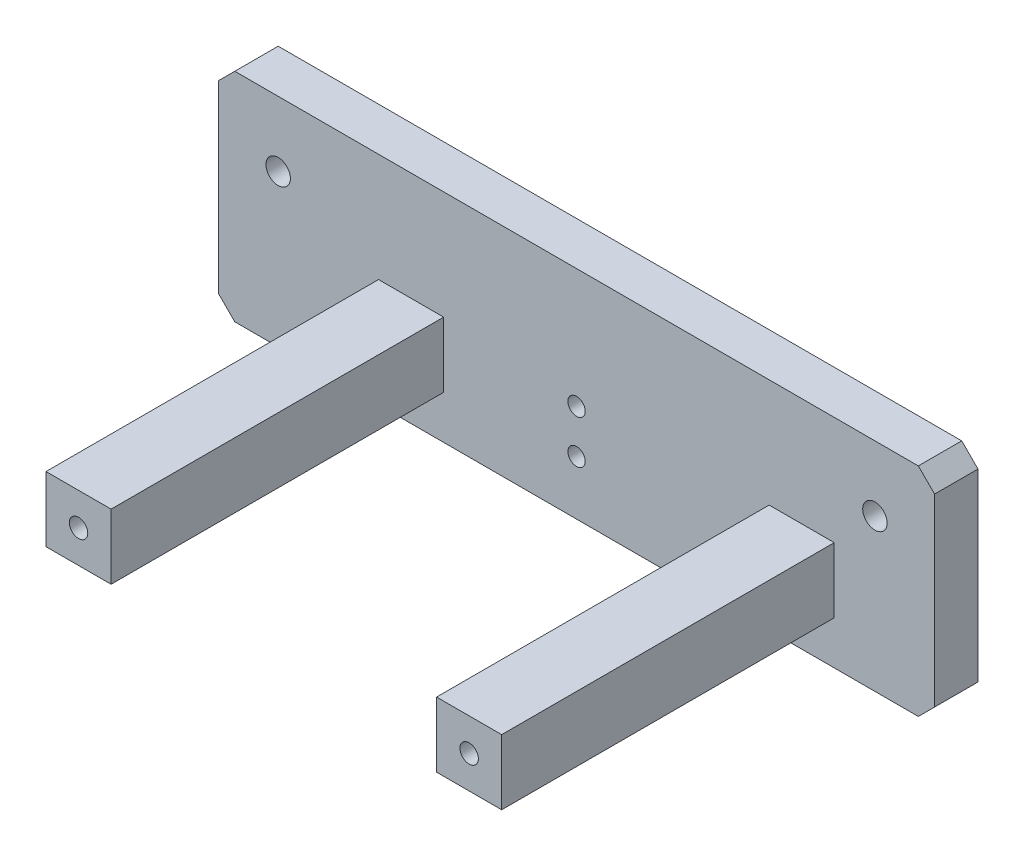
from build123d import *

# Parameters (mm, degrees)
SKETCH_1_R                         = 2.25
SKETCH_1_R_2                       = 1.7
SKETCH_1_R_3                       = 1.6
COMMON_FLANGE_M4_PITCH110_DEPTH    = 8
FIXED_LENGTH_ARMS_M3_THROUGH_START = 8
SKETCH_2_W                         = 12
SKETCH_2_H                         = 12
SKETCH_2_R                         = 1.7
FIXED_LENGTH_ARMS_M3_THROUGH_DEPTH = 61.3


with BuildPart() as part:
    # Sketch 1 → Common_flange_M4_pitch110 (new body)
    with BuildSketch(Plane.XY):
        Polygon((-63, -20), (63, -20), (66, -17), (66, 17), (63, 20), (-63, 20), (-66, 17), (-66, -17), align=None)
        with Locations((-55, 8)):
            Circle(SKETCH_1_R, mode=Mode.SUBTRACT)
        with Locations((55, 8)):
            Circle(SKETCH_1_R, mode=Mode.SUBTRACT)
        with Locations((-30.5, -6)):
            Circle(SKETCH_1_R_2, mode=Mode.SUBTRACT)
        with Locations((41.5, -6)):
            Circle(SKETCH_1_R_2, mode=Mode.SUBTRACT)
        with Locations((0, -10)):
            Circle(SKETCH_1_R_3, mode=Mode.SUBTRACT)
        with Locations((0, -2)):
            Circle(SKETCH_1_R_3, mode=Mode.SUBTRACT)
    extrude(amount=COMMON_FLANGE_M4_PITCH110_DEPTH)

    # Sketch 2 → Fixed_length_arms_M3_through (add)
    # profile 1 of 2: a face of its own
    with BuildSketch(Plane.XY.offset(FIXED_LENGTH_ARMS_M3_THROUGH_START)):
        with Locations((-30.5, -6)):
            Rectangle(SKETCH_2_W, SKETCH_2_H)
        with Locations((-30.5, -6)):
            Circle(SKETCH_2_R, mode=Mode.SUBTRACT)
    # profile 2 of 2: a face of its own
    with BuildSketch(Plane.XY.offset(FIXED_LENGTH_ARMS_M3_THROUGH_START)):
        with Locations((41.5, -6)):
            Rectangle(SKETCH_2_W, SKETCH_2_H)
        with Locations((41.5, -6)):
            Circle(SKETCH_2_R, mode=Mode.SUBTRACT)
    extrude(amount=FIXED_LENGTH_ARMS_M3_THROUGH_DEPTH)


solid = part.part
